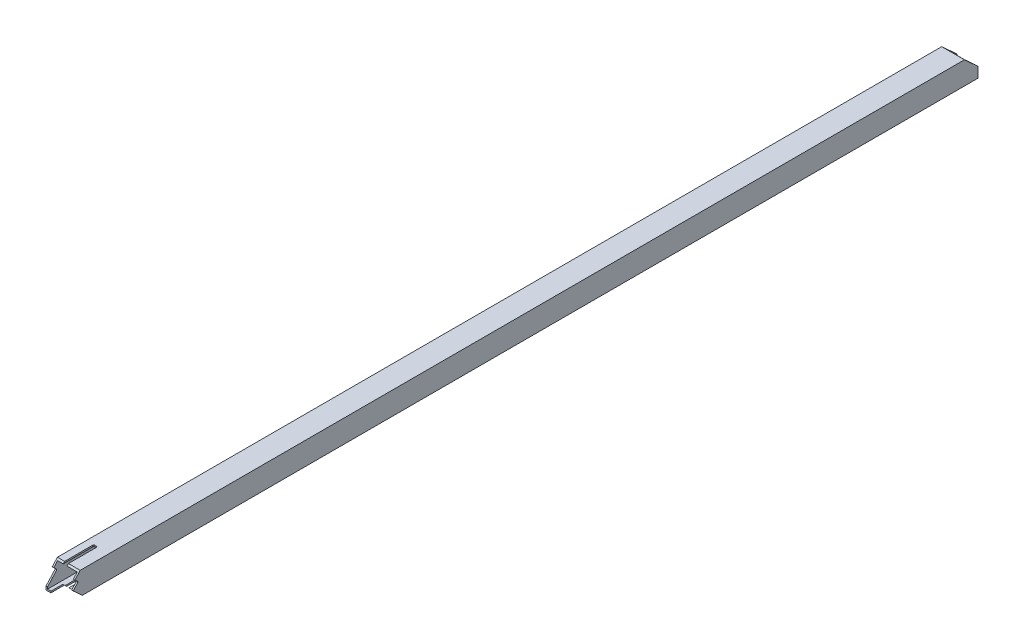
ISO-10303-21;
HEADER;
FILE_DESCRIPTION(('STEP AP214'),'2;1');
FILE_NAME('part.step','',(''),(''),'','','');
FILE_SCHEMA(('AUTOMOTIVE_DESIGN { 1 0 10303 214 1 1 1 1 }'));
ENDSEC;
DATA;
#1=APPLICATION_CONTEXT('core data for automotive mechanical design processes');
#2=APPLICATION_PROTOCOL_DEFINITION('international standard','automotive_design',2000,#1);
#3=PRODUCT_CONTEXT('',#1,'mechanical');
#4=PRODUCT('Part','Part','',(#3));
#5=PRODUCT_RELATED_PRODUCT_CATEGORY('part','',(#4));
#6=PRODUCT_DEFINITION_FORMATION('','',#4);
#7=PRODUCT_DEFINITION_CONTEXT('part definition',#1,'design');
#8=PRODUCT_DEFINITION('design','',#6,#7);
#9=PRODUCT_DEFINITION_SHAPE('','',#8);
#10=(LENGTH_UNIT() NAMED_UNIT(*) SI_UNIT(.MILLI.,.METRE.));
#11=(NAMED_UNIT(*) PLANE_ANGLE_UNIT() SI_UNIT($,.RADIAN.));
#12=(NAMED_UNIT(*) SI_UNIT($,.STERADIAN.) SOLID_ANGLE_UNIT());
#13=UNCERTAINTY_MEASURE_WITH_UNIT(LENGTH_MEASURE(1.E-05),#10,'distance_accuracy_value','');
#14=(GEOMETRIC_REPRESENTATION_CONTEXT(3) GLOBAL_UNCERTAINTY_ASSIGNED_CONTEXT((#13)) GLOBAL_UNIT_ASSIGNED_CONTEXT((#10,
#11,#12)) REPRESENTATION_CONTEXT('',''));
#15=CARTESIAN_POINT('',(0.,0.,0.));
#16=DIRECTION('',(0.,0.,1.));
#17=DIRECTION('',(1.,0.,0.));
#18=AXIS2_PLACEMENT_3D('',#15,#16,#17);
#19=CARTESIAN_POINT('',(-1.,3.344636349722,2323.848652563));
#20=DIRECTION('',(-1.,0.,0.));
#21=DIRECTION('',(0.,0.,1.));
#22=AXIS2_PLACEMENT_3D('',#19,#20,#21);
#23=PLANE('',#22);
#24=DIRECTION('',(0.,0.,-1.));
#25=VECTOR('',#24,1.);
#26=CARTESIAN_POINT('',(-1.,30.,1161.924326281));
#27=LINE('',#26,#25);
#28=CARTESIAN_POINT('',(-1.,30.,2369.268578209));
#29=VERTEX_POINT('',#28);
#30=CARTESIAN_POINT('',(-1.,30.,2294.595069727));
#31=VERTEX_POINT('',#30);
#32=EDGE_CURVE('E293',#29,#31,#27,.T.);
#33=ORIENTED_EDGE('',*,*,#32,.T.);
#34=DIRECTION('',(0.,-0.999022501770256,-0.0442045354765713));
#35=VECTOR('',#34,1.);
#36=CARTESIAN_POINT('',(-1.,110.65093685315,2298.163695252));
#37=LINE('',#36,#35);
#38=CARTESIAN_POINT('',(-1.,26.,2294.418078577));
#39=VERTEX_POINT('',#38);
#40=EDGE_CURVE('E10',#31,#39,#37,.T.);
#41=ORIENTED_EDGE('',*,*,#40,.T.);
#42=DIRECTION('',(0.,0.,-1.));
#43=VECTOR('',#42,1.);
#44=CARTESIAN_POINT('',(-1.,26.,1161.924326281));
#45=LINE('',#44,#43);
#46=CARTESIAN_POINT('',(-1.,26.,2372.929595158));
#47=VERTEX_POINT('',#46);
#48=EDGE_CURVE('E223',#47,#39,#45,.T.);
#49=ORIENTED_EDGE('',*,*,#48,.F.);
#50=DIRECTION('',(0.,-0.737672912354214,0.675158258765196));
#51=VECTOR('',#50,1.);
#52=CARTESIAN_POINT('',(-1.,645.40501344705,1806.016532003));
#53=LINE('',#52,#51);
#54=EDGE_CURVE('E289',#29,#47,#53,.T.);
#55=ORIENTED_EDGE('',*,*,#54,.F.);
#56=EDGE_LOOP('',(#33,#41,#49,#55));
#57=FACE_BOUND('',#56,.T.);
#58=ADVANCED_FACE('F16',(#57),#23,.T.);
#59=CARTESIAN_POINT('',(-3.,110.65093685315,2298.163695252));
#60=DIRECTION('',(0.,-0.999022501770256,-0.0442045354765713));
#61=DIRECTION('',(-1.,0.,0.));
#62=AXIS2_PLACEMENT_3D('',#59,#60,#61);
#63=CYLINDRICAL_SURFACE('',#62,2.);
#64=CARTESIAN_POINT('',(-3.,26.,2294.418078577));
#65=DIRECTION('',(0.,-1.,0.));
#66=DIRECTION('',(0.,0.,-1.));
#67=AXIS2_PLACEMENT_3D('',#64,#65,#66);
#68=ELLIPSE('',#67,2.001956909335,2.);
#69=CARTESIAN_POINT('',(-3.,26.,2292.416121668));
#70=VERTEX_POINT('',#69);
#71=EDGE_CURVE('E203',#70,#39,#68,.T.);
#72=ORIENTED_EDGE('',*,*,#71,.T.);
#73=ORIENTED_EDGE('',*,*,#40,.F.);
#74=CARTESIAN_POINT('',(-3.,30.,2294.595069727));
#75=DIRECTION('',(0.,-1.,0.));
#76=DIRECTION('',(0.,0.,-1.));
#77=AXIS2_PLACEMENT_3D('',#74,#75,#76);
#78=ELLIPSE('',#77,2.001956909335,2.);
#79=CARTESIAN_POINT('',(-3.,30.,2292.593112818));
#80=VERTEX_POINT('',#79);
#81=EDGE_CURVE('E206',#80,#31,#78,.T.);
#82=ORIENTED_EDGE('',*,*,#81,.F.);
#83=DIRECTION('',(0.,-0.999022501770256,-0.0442045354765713));
#84=VECTOR('',#83,1.);
#85=CARTESIAN_POINT('',(-3.,110.7393459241,2296.165650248));
#86=LINE('',#85,#84);
#87=EDGE_CURVE('E25',#80,#70,#86,.T.);
#88=ORIENTED_EDGE('',*,*,#87,.T.);
#89=EDGE_LOOP('',(#72,#73,#82,#88));
#90=FACE_BOUND('',#89,.T.);
#91=ADVANCED_FACE('F201',(#90),#63,.F.);
#92=CARTESIAN_POINT('',(-3.,110.7393459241,2296.165650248));
#93=DIRECTION('',(0.,-0.0442045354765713,0.999022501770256));
#94=DIRECTION('',(-1.,0.,0.));
#95=AXIS2_PLACEMENT_3D('',#92,#93,#94);
#96=PLANE('',#95);
#97=ORIENTED_EDGE('',*,*,#87,.F.);
#98=DIRECTION('',(-1.,0.,0.));
#99=VECTOR('',#98,1.);
#100=CARTESIAN_POINT('',(13.5,30.,2292.593112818));
#101=LINE('',#100,#99);
#102=CARTESIAN_POINT('',(-9.,30.,2292.593112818));
#103=VERTEX_POINT('',#102);
#104=EDGE_CURVE('E281',#80,#103,#101,.T.);
#105=ORIENTED_EDGE('',*,*,#104,.T.);
#106=DIRECTION('',(0.,-0.999022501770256,-0.0442045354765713));
#107=VECTOR('',#106,1.);
#108=CARTESIAN_POINT('',(-9.,110.7393459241,2296.165650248));
#109=LINE('',#108,#107);
#110=CARTESIAN_POINT('',(-9.,26.,2292.416121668));
#111=VERTEX_POINT('',#110);
#112=EDGE_CURVE('E211',#103,#111,#109,.T.);
#113=ORIENTED_EDGE('',*,*,#112,.T.);
#114=DIRECTION('',(-1.,0.,0.));
#115=VECTOR('',#114,1.);
#116=CARTESIAN_POINT('',(11.5,26.,2292.416121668));
#117=LINE('',#116,#115);
#118=EDGE_CURVE('E213',#70,#111,#117,.T.);
#119=ORIENTED_EDGE('',*,*,#118,.F.);
#120=EDGE_LOOP('',(#97,#105,#113,#119));
#121=FACE_BOUND('',#120,.T.);
#122=ADVANCED_FACE('F214',(#121),#96,.T.);
#123=CARTESIAN_POINT('',(-9.,110.65093685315,2298.163695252));
#124=DIRECTION('',(0.,-0.999022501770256,-0.0442045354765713));
#125=DIRECTION('',(1.,0.,0.));
#126=AXIS2_PLACEMENT_3D('',#123,#124,#125);
#127=CYLINDRICAL_SURFACE('',#126,2.);
#128=ORIENTED_EDGE('',*,*,#112,.F.);
#129=CARTESIAN_POINT('',(-9.,30.,2294.595069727));
#130=DIRECTION('',(0.,-1.,0.));
#131=DIRECTION('',(0.,0.,-1.));
#132=AXIS2_PLACEMENT_3D('',#129,#130,#131);
#133=ELLIPSE('',#132,2.001956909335,2.);
#134=CARTESIAN_POINT('',(-11.,30.,2294.595069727));
#135=VERTEX_POINT('',#134);
#136=EDGE_CURVE('E284',#135,#103,#133,.T.);
#137=ORIENTED_EDGE('',*,*,#136,.F.);
#138=DIRECTION('',(0.,-0.999022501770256,-0.0442045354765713));
#139=VECTOR('',#138,1.);
#140=CARTESIAN_POINT('',(-11.,110.65093685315,2298.163695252));
#141=LINE('',#140,#139);
#142=CARTESIAN_POINT('',(-11.,26.,2294.418078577));
#143=VERTEX_POINT('',#142);
#144=EDGE_CURVE('E38',#135,#143,#141,.T.);
#145=ORIENTED_EDGE('',*,*,#144,.T.);
#146=CARTESIAN_POINT('',(-9.,26.,2294.418078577));
#147=DIRECTION('',(0.,-1.,0.));
#148=DIRECTION('',(0.,0.,-1.));
#149=AXIS2_PLACEMENT_3D('',#146,#147,#148);
#150=ELLIPSE('',#149,2.001956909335,2.);
#151=EDGE_CURVE('E218',#143,#111,#150,.T.);
#152=ORIENTED_EDGE('',*,*,#151,.T.);
#153=EDGE_LOOP('',(#128,#137,#145,#152));
#154=FACE_BOUND('',#153,.T.);
#155=ADVANCED_FACE('F764',(#154),#127,.F.);
#156=CARTESIAN_POINT('',(-11.,3.344636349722,2323.848652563));
#157=DIRECTION('',(-1.,0.,0.));
#158=DIRECTION('',(0.,0.,1.));
#159=AXIS2_PLACEMENT_3D('',#156,#157,#158);
#160=PLANE('',#159);
#161=DIRECTION('',(0.,-0.737672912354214,0.675158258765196));
#162=VECTOR('',#161,1.);
#163=CARTESIAN_POINT('',(-11.,645.40501344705,1806.016532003));
#164=LINE('',#163,#162);
#165=CARTESIAN_POINT('',(-11.,30.,2369.268578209));
#166=VERTEX_POINT('',#165);
#167=CARTESIAN_POINT('',(-11.,26.,2372.929595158));
#168=VERTEX_POINT('',#167);
#169=EDGE_CURVE('E230',#166,#168,#164,.T.);
#170=ORIENTED_EDGE('',*,*,#169,.T.);
#171=DIRECTION('',(0.,0.,-1.));
#172=VECTOR('',#171,1.);
#173=CARTESIAN_POINT('',(-11.,26.,1161.924326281));
#174=LINE('',#173,#172);
#175=EDGE_CURVE('E278',#168,#143,#174,.T.);
#176=ORIENTED_EDGE('',*,*,#175,.T.);
#177=ORIENTED_EDGE('',*,*,#144,.F.);
#178=DIRECTION('',(0.,0.,-1.));
#179=VECTOR('',#178,1.);
#180=CARTESIAN_POINT('',(-11.,30.,1161.924326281));
#181=LINE('',#180,#179);
#182=EDGE_CURVE('E277',#166,#135,#181,.T.);
#183=ORIENTED_EDGE('',*,*,#182,.F.);
#184=EDGE_LOOP('',(#170,#176,#177,#183));
#185=FACE_BOUND('',#184,.T.);
#186=ADVANCED_FACE('F766',(#185),#160,.F.);
#187=CARTESIAN_POINT('',(26.,26.,0.));
#188=DIRECTION('',(0.,-1.,0.));
#189=DIRECTION('',(0.,0.,-1.));
#190=AXIS2_PLACEMENT_3D('',#187,#188,#189);
#191=PLANE('',#190);
#192=DIRECTION('',(-1.,0.,0.));
#193=VECTOR('',#192,1.);
#194=CARTESIAN_POINT('',(-8.00000005,26.,31.36967599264));
#195=LINE('',#194,#193);
#196=CARTESIAN_POINT('',(26.,26.,31.36967599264));
#197=VERTEX_POINT('',#196);
#198=CARTESIAN_POINT('',(-26.,26.,31.36967599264));
#199=VERTEX_POINT('',#198);
#200=EDGE_CURVE('E329',#197,#199,#195,.T.);
#201=ORIENTED_EDGE('',*,*,#200,.F.);
#202=DIRECTION('',(0.,0.,1.));
#203=VECTOR('',#202,1.);
#204=CARTESIAN_POINT('',(26.,26.,0.));
#205=LINE('',#204,#203);
#206=CARTESIAN_POINT('',(26.,26.,2372.929595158));
#207=VERTEX_POINT('',#206);
#208=EDGE_CURVE('E270',#197,#207,#205,.T.);
#209=ORIENTED_EDGE('',*,*,#208,.T.);
#210=DIRECTION('',(-1.,0.,0.));
#211=VECTOR('',#210,1.);
#212=CARTESIAN_POINT('',(-5.75,26.,2372.929595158));
#213=LINE('',#212,#211);
#214=EDGE_CURVE('E698',#207,#47,#213,.T.);
#215=ORIENTED_EDGE('',*,*,#214,.T.);
#216=ORIENTED_EDGE('',*,*,#48,.T.);
#217=ORIENTED_EDGE('',*,*,#71,.F.);
#218=ORIENTED_EDGE('',*,*,#118,.T.);
#219=ORIENTED_EDGE('',*,*,#151,.F.);
#220=ORIENTED_EDGE('',*,*,#175,.F.);
#221=DIRECTION('',(-1.,0.,0.));
#222=VECTOR('',#221,1.);
#223=CARTESIAN_POINT('',(-5.75,26.,2372.929595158));
#224=LINE('',#223,#222);
#225=CARTESIAN_POINT('',(-26.,26.,2372.929595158));
#226=VERTEX_POINT('',#225);
#227=EDGE_CURVE('E244',#168,#226,#224,.T.);
#228=ORIENTED_EDGE('',*,*,#227,.T.);
#229=DIRECTION('',(0.,0.,1.));
#230=VECTOR('',#229,1.);
#231=CARTESIAN_POINT('',(-26.,26.,0.));
#232=LINE('',#231,#230);
#233=EDGE_CURVE('E234',#199,#226,#232,.T.);
#234=ORIENTED_EDGE('',*,*,#233,.F.);
#235=EDGE_LOOP('',(#201,#209,#215,#216,#217,#218,#219,#220,#228,#234));
#236=FACE_BOUND('',#235,.T.);
#237=ADVANCED_FACE('F221',(#236),#191,.T.);
#238=CARTESIAN_POINT('',(-37.5,1252.693634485,1250.193048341));
#239=DIRECTION('',(0.,0.675158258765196,0.737672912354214));
#240=DIRECTION('',(1.,0.,0.));
#241=AXIS2_PLACEMENT_3D('',#238,#239,#240);
#242=PLANE('',#241);
#243=ORIENTED_EDGE('',*,*,#227,.F.);
#244=ORIENTED_EDGE('',*,*,#169,.F.);
#245=DIRECTION('',(-1.,0.,0.));
#246=VECTOR('',#245,1.);
#247=CARTESIAN_POINT('',(-3.75,30.,2369.268578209));
#248=LINE('',#247,#246);
#249=CARTESIAN_POINT('',(-30.,30.,2369.268578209));
#250=VERTEX_POINT('',#249);
#251=EDGE_CURVE('E274',#166,#250,#248,.T.);
#252=ORIENTED_EDGE('',*,*,#251,.T.);
#253=DIRECTION('',(0.,-0.737672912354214,0.675158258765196));
#254=VECTOR('',#253,1.);
#255=CARTESIAN_POINT('',(-30.,1231.349137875,1269.728689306));
#256=LINE('',#255,#254);
#257=CARTESIAN_POINT('',(-30.,14.878487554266,2383.108606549));
#258=VERTEX_POINT('',#257);
#259=EDGE_CURVE('E342',#250,#258,#256,.T.);
#260=ORIENTED_EDGE('',*,*,#259,.T.);
#261=DIRECTION('',(1.,0.,0.));
#262=VECTOR('',#261,1.);
#263=CARTESIAN_POINT('',(23.75,14.878487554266,2383.108606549));
#264=LINE('',#263,#262);
#265=CARTESIAN_POINT('',(-26.,14.878487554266,2383.108606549));
#266=VERTEX_POINT('',#265);
#267=EDGE_CURVE('E240',#258,#266,#264,.T.);
#268=ORIENTED_EDGE('',*,*,#267,.T.);
#269=DIRECTION('',(0.,-0.737672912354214,0.675158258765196));
#270=VECTOR('',#269,1.);
#271=CARTESIAN_POINT('',(-26.,1230.260815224,1270.724781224));
#272=LINE('',#271,#270);
#273=EDGE_CURVE('E236',#226,#266,#272,.T.);
#274=ORIENTED_EDGE('',*,*,#273,.F.);
#275=EDGE_LOOP('',(#243,#244,#252,#260,#268,#274));
#276=FACE_BOUND('',#275,.T.);
#277=ADVANCED_FACE('F648',(#276),#242,.T.);
#278=CARTESIAN_POINT('',(85.,8.126904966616,2375.731877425));
#279=DIRECTION('',(0.,-0.737672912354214,0.675158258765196));
#280=DIRECTION('',(-1.,0.,0.));
#281=AXIS2_PLACEMENT_3D('',#278,#279,#280);
#282=PLANE('',#281);
#283=DIRECTION('',(-1.,0.,0.));
#284=VECTOR('',#283,1.);
#285=CARTESIAN_POINT('',(85.,8.126904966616,2375.731877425));
#286=LINE('',#285,#284);
#287=CARTESIAN_POINT('',(-26.,8.126904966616,2375.731877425));
#288=VERTEX_POINT('',#287);
#289=CARTESIAN_POINT('',(-30.,8.126904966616,2375.731877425));
#290=VERTEX_POINT('',#289);
#291=EDGE_CURVE('E245',#288,#290,#286,.T.);
#292=ORIENTED_EDGE('',*,*,#291,.F.);
#293=DIRECTION('',(0.,-0.675158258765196,-0.737672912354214));
#294=VECTOR('',#293,1.);
#295=CARTESIAN_POINT('',(-26.,-579.4113017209,1733.791984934));
#296=LINE('',#295,#294);
#297=EDGE_CURVE('E239',#266,#288,#296,.T.);
#298=ORIENTED_EDGE('',*,*,#297,.F.);
#299=ORIENTED_EDGE('',*,*,#267,.F.);
#300=DIRECTION('',(0.,-0.675158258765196,-0.737672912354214));
#301=VECTOR('',#300,1.);
#302=CARTESIAN_POINT('',(-30.,-578.4996243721,1734.788076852));
#303=LINE('',#302,#301);
#304=EDGE_CURVE('E339',#258,#290,#303,.T.);
#305=ORIENTED_EDGE('',*,*,#304,.T.);
#306=EDGE_LOOP('',(#292,#298,#299,#305));
#307=FACE_BOUND('',#306,.T.);
#308=ADVANCED_FACE('F643',(#307),#282,.T.);
#309=CARTESIAN_POINT('',(85.,6.651559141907,2377.082193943));
#310=DIRECTION('',(-1.,0.,0.));
#311=DIRECTION('',(0.,0.675158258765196,0.737672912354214));
#312=AXIS2_PLACEMENT_3D('',#309,#310,#311);
#313=CYLINDRICAL_SURFACE('',#312,2.);
#314=CARTESIAN_POINT('',(-30.,6.651559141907,2377.082193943));
#315=DIRECTION('',(-1.,0.,0.));
#316=DIRECTION('',(0.,0.675158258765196,0.737672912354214));
#317=AXIS2_PLACEMENT_3D('',#314,#315,#316);
#318=CIRCLE('',#317,2.);
#319=CARTESIAN_POINT('',(-30.,5.301242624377,2375.606848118));
#320=VERTEX_POINT('',#319);
#321=EDGE_CURVE('E332',#290,#320,#318,.T.);
#322=ORIENTED_EDGE('',*,*,#321,.T.);
#323=DIRECTION('',(-1.,0.,0.));
#324=VECTOR('',#323,1.);
#325=CARTESIAN_POINT('',(85.,5.301242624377,2375.606848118));
#326=LINE('',#325,#324);
#327=CARTESIAN_POINT('',(-26.,5.301242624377,2375.606848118));
#328=VERTEX_POINT('',#327);
#329=EDGE_CURVE('E262',#328,#320,#326,.T.);
#330=ORIENTED_EDGE('',*,*,#329,.F.);
#331=CARTESIAN_POINT('',(-26.,6.651559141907,2377.082193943));
#332=DIRECTION('',(-1.,0.,0.));
#333=DIRECTION('',(0.,0.675158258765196,0.737672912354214));
#334=AXIS2_PLACEMENT_3D('',#331,#332,#333);
#335=CIRCLE('',#334,2.);
#336=EDGE_CURVE('E250',#288,#328,#335,.T.);
#337=ORIENTED_EDGE('',*,*,#336,.F.);
#338=ORIENTED_EDGE('',*,*,#291,.T.);
#339=EDGE_LOOP('',(#322,#330,#337,#338));
#340=FACE_BOUND('',#339,.T.);
#341=ADVANCED_FACE('F639',(#340),#313,.F.);
#342=CARTESIAN_POINT('',(25.,-38.95913211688,2416.116343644));
#343=DIRECTION('',(0.,0.675158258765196,0.737672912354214));
#344=DIRECTION('',(1.,0.,0.));
#345=AXIS2_PLACEMENT_3D('',#342,#343,#344);
#346=PLANE('',#345);
#347=ORIENTED_EDGE('',*,*,#329,.T.);
#348=DIRECTION('',(0.,-0.737672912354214,0.675158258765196));
#349=VECTOR('',#348,1.);
#350=CARTESIAN_POINT('',(-30.,581.47180502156,1848.264299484));
#351=LINE('',#350,#349);
#352=CARTESIAN_POINT('',(-30.,-20.73587909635,2399.4374341));
#353=VERTEX_POINT('',#352);
#354=EDGE_CURVE('E323',#320,#353,#351,.T.);
#355=ORIENTED_EDGE('',*,*,#354,.T.);
#356=DIRECTION('',(-1.,0.,0.));
#357=VECTOR('',#356,1.);
#358=CARTESIAN_POINT('',(12.5,-20.73587909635,2399.4374341));
#359=LINE('',#358,#357);
#360=CARTESIAN_POINT('',(-26.,-20.73587909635,2399.4374341));
#361=VERTEX_POINT('',#360);
#362=EDGE_CURVE('E316',#361,#353,#359,.T.);
#363=ORIENTED_EDGE('',*,*,#362,.F.);
#364=DIRECTION('',(0.,-0.737672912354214,0.675158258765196));
#365=VECTOR('',#364,1.);
#366=CARTESIAN_POINT('',(-26.,580.38348237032,1849.260391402));
#367=LINE('',#366,#365);
#368=EDGE_CURVE('E246',#328,#361,#367,.T.);
#369=ORIENTED_EDGE('',*,*,#368,.F.);
#370=EDGE_LOOP('',(#347,#355,#363,#369));
#371=FACE_BOUND('',#370,.T.);
#372=ADVANCED_FACE('F827',(#371),#346,.T.);
#373=CARTESIAN_POINT('',(25.,-38.95913211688,2416.116343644));
#374=DIRECTION('',(0.,0.675158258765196,0.737672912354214));
#375=DIRECTION('',(1.,0.,0.));
#376=AXIS2_PLACEMENT_3D('',#373,#374,#375);
#377=PLANE('',#376);
#378=DIRECTION('',(-1.,0.,0.));
#379=VECTOR('',#378,1.);
#380=CARTESIAN_POINT('',(85.,5.301242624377,2375.606848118));
#381=LINE('',#380,#379);
#382=CARTESIAN_POINT('',(30.,5.301242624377,2375.606848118));
#383=VERTEX_POINT('',#382);
#384=CARTESIAN_POINT('',(26.,5.301242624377,2375.606848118));
#385=VERTEX_POINT('',#384);
#386=EDGE_CURVE('E296',#383,#385,#381,.T.);
#387=ORIENTED_EDGE('',*,*,#386,.T.);
#388=DIRECTION('',(0.,0.737672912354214,-0.675158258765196));
#389=VECTOR('',#388,1.);
#390=CARTESIAN_POINT('',(26.,566.23528790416,1862.209586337));
#391=LINE('',#390,#389);
#392=CARTESIAN_POINT('',(26.,-7.976869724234,2387.759696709));
#393=VERTEX_POINT('',#392);
#394=EDGE_CURVE('E259',#393,#385,#391,.T.);
#395=ORIENTED_EDGE('',*,*,#394,.F.);
#396=DIRECTION('',(-1.,0.,0.));
#397=VECTOR('',#396,1.);
#398=CARTESIAN_POINT('',(3.99999995,-7.976869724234,2387.759696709));
#399=LINE('',#398,#397);
#400=CARTESIAN_POINT('',(30.,-7.976869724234,2387.759696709));
#401=VERTEX_POINT('',#400);
#402=EDGE_CURVE('E443',#401,#393,#399,.T.);
#403=ORIENTED_EDGE('',*,*,#402,.F.);
#404=DIRECTION('',(0.,0.737672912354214,-0.675158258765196));
#405=VECTOR('',#404,1.);
#406=CARTESIAN_POINT('',(30.,565.14696525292,1863.205678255));
#407=LINE('',#406,#405);
#408=EDGE_CURVE('E431',#401,#383,#407,.T.);
#409=ORIENTED_EDGE('',*,*,#408,.T.);
#410=EDGE_LOOP('',(#387,#395,#403,#409));
#411=FACE_BOUND('',#410,.T.);
#412=ADVANCED_FACE('F837',(#411),#377,.T.);
#413=CARTESIAN_POINT('',(85.,6.651559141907,2377.082193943));
#414=DIRECTION('',(-1.,0.,0.));
#415=DIRECTION('',(0.,0.675158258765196,0.737672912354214));
#416=AXIS2_PLACEMENT_3D('',#413,#414,#415);
#417=CYLINDRICAL_SURFACE('',#416,2.);
#418=CARTESIAN_POINT('',(26.,6.651559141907,2377.082193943));
#419=DIRECTION('',(-1.,0.,0.));
#420=DIRECTION('',(0.,0.675158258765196,0.737672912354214));
#421=AXIS2_PLACEMENT_3D('',#418,#419,#420);
#422=CIRCLE('',#421,2.);
#423=CARTESIAN_POINT('',(26.,8.126904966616,2375.731877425));
#424=VERTEX_POINT('',#423);
#425=EDGE_CURVE('E254',#424,#385,#422,.T.);
#426=ORIENTED_EDGE('',*,*,#425,.T.);
#427=ORIENTED_EDGE('',*,*,#386,.F.);
#428=CARTESIAN_POINT('',(30.,6.651559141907,2377.082193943));
#429=DIRECTION('',(-1.,0.,0.));
#430=DIRECTION('',(0.,0.675158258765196,0.737672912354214));
#431=AXIS2_PLACEMENT_3D('',#428,#429,#430);
#432=CIRCLE('',#431,2.);
#433=CARTESIAN_POINT('',(30.,8.126904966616,2375.731877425));
#434=VERTEX_POINT('',#433);
#435=EDGE_CURVE('E424',#434,#383,#432,.T.);
#436=ORIENTED_EDGE('',*,*,#435,.F.);
#437=DIRECTION('',(-1.,0.,0.));
#438=VECTOR('',#437,1.);
#439=CARTESIAN_POINT('',(85.,8.126904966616,2375.731877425));
#440=LINE('',#439,#438);
#441=EDGE_CURVE('E299',#434,#424,#440,.T.);
#442=ORIENTED_EDGE('',*,*,#441,.T.);
#443=EDGE_LOOP('',(#426,#427,#436,#442));
#444=FACE_BOUND('',#443,.T.);
#445=ADVANCED_FACE('F848',(#444),#417,.F.);
#446=CARTESIAN_POINT('',(85.,8.126904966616,2375.731877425));
#447=DIRECTION('',(0.,-0.737672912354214,0.675158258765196));
#448=DIRECTION('',(-1.,0.,0.));
#449=AXIS2_PLACEMENT_3D('',#446,#447,#448);
#450=PLANE('',#449);
#451=ORIENTED_EDGE('',*,*,#441,.F.);
#452=DIRECTION('',(0.,0.675158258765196,0.737672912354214));
#453=VECTOR('',#452,1.);
#454=CARTESIAN_POINT('',(30.,-592.1747846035,1719.84669808));
#455=LINE('',#454,#453);
#456=CARTESIAN_POINT('',(30.,14.878487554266,2383.108606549));
#457=VERTEX_POINT('',#456);
#458=EDGE_CURVE('E420',#434,#457,#455,.T.);
#459=ORIENTED_EDGE('',*,*,#458,.T.);
#460=DIRECTION('',(1.,0.,0.));
#461=VECTOR('',#460,1.);
#462=CARTESIAN_POINT('',(23.75,14.878487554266,2383.108606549));
#463=LINE('',#462,#461);
#464=CARTESIAN_POINT('',(26.,14.878487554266,2383.108606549));
#465=VERTEX_POINT('',#464);
#466=EDGE_CURVE('E285',#465,#457,#463,.T.);
#467=ORIENTED_EDGE('',*,*,#466,.F.);
#468=DIRECTION('',(0.,0.675158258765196,0.737672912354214));
#469=VECTOR('',#468,1.);
#470=CARTESIAN_POINT('',(26.,-591.2631072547,1720.842789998));
#471=LINE('',#470,#469);
#472=EDGE_CURVE('E258',#424,#465,#471,.T.);
#473=ORIENTED_EDGE('',*,*,#472,.F.);
#474=EDGE_LOOP('',(#451,#459,#467,#473));
#475=FACE_BOUND('',#474,.T.);
#476=ADVANCED_FACE('F858',(#475),#450,.T.);
#477=CARTESIAN_POINT('',(-37.5,1252.693634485,1250.193048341));
#478=DIRECTION('',(0.,0.675158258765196,0.737672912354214));
#479=DIRECTION('',(1.,0.,0.));
#480=AXIS2_PLACEMENT_3D('',#477,#478,#479);
#481=PLANE('',#480);
#482=DIRECTION('',(0.,0.737672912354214,-0.675158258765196));
#483=VECTOR('',#482,1.);
#484=CARTESIAN_POINT('',(26.,1216.112620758,1283.673976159));
#485=LINE('',#484,#483);
#486=EDGE_CURVE('E266',#465,#207,#485,.T.);
#487=ORIENTED_EDGE('',*,*,#486,.F.);
#488=ORIENTED_EDGE('',*,*,#466,.T.);
#489=DIRECTION('',(0.,0.737672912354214,-0.675158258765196));
#490=VECTOR('',#489,1.);
#491=CARTESIAN_POINT('',(30.,1215.024298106,1284.670068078));
#492=LINE('',#491,#490);
#493=CARTESIAN_POINT('',(30.,30.,2369.268578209));
#494=VERTEX_POINT('',#493);
#495=EDGE_CURVE('E416',#457,#494,#492,.T.);
#496=ORIENTED_EDGE('',*,*,#495,.T.);
#497=DIRECTION('',(-1.,0.,0.));
#498=VECTOR('',#497,1.);
#499=CARTESIAN_POINT('',(-3.75,30.,2369.268578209));
#500=LINE('',#499,#498);
#501=EDGE_CURVE('E290',#494,#29,#500,.T.);
#502=ORIENTED_EDGE('',*,*,#501,.T.);
#503=ORIENTED_EDGE('',*,*,#54,.T.);
#504=ORIENTED_EDGE('',*,*,#214,.F.);
#505=EDGE_LOOP('',(#487,#488,#496,#502,#503,#504));
#506=FACE_BOUND('',#505,.T.);
#507=ADVANCED_FACE('F621',(#506),#481,.T.);
#508=CARTESIAN_POINT('',(30.,30.,0.));
#509=DIRECTION('',(0.,-1.,0.));
#510=DIRECTION('',(0.,0.,-1.));
#511=AXIS2_PLACEMENT_3D('',#508,#509,#510);
#512=PLANE('',#511);
#513=DIRECTION('',(0.,0.,1.));
#514=VECTOR('',#513,1.);
#515=CARTESIAN_POINT('',(-30.,30.,0.));
#516=LINE('',#515,#514);
#517=CARTESIAN_POINT('',(-30.,30.,35.74004636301));
#518=VERTEX_POINT('',#517);
#519=EDGE_CURVE('E349',#518,#250,#516,.T.);
#520=ORIENTED_EDGE('',*,*,#519,.T.);
#521=ORIENTED_EDGE('',*,*,#251,.F.);
#522=ORIENTED_EDGE('',*,*,#182,.T.);
#523=ORIENTED_EDGE('',*,*,#136,.T.);
#524=ORIENTED_EDGE('',*,*,#104,.F.);
#525=ORIENTED_EDGE('',*,*,#81,.T.);
#526=ORIENTED_EDGE('',*,*,#32,.F.);
#527=ORIENTED_EDGE('',*,*,#501,.F.);
#528=DIRECTION('',(0.,0.,1.));
#529=VECTOR('',#528,1.);
#530=CARTESIAN_POINT('',(30.,30.,0.));
#531=LINE('',#530,#529);
#532=CARTESIAN_POINT('',(30.,30.,35.74004636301));
#533=VERTEX_POINT('',#532);
#534=EDGE_CURVE('E412',#533,#494,#531,.T.);
#535=ORIENTED_EDGE('',*,*,#534,.F.);
#536=DIRECTION('',(-1.,0.,0.));
#537=VECTOR('',#536,1.);
#538=CARTESIAN_POINT('',(-6.00000005,30.,35.74004636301));
#539=LINE('',#538,#537);
#540=EDGE_CURVE('E328',#533,#518,#539,.T.);
#541=ORIENTED_EDGE('',*,*,#540,.T.);
#542=EDGE_LOOP('',(#520,#521,#522,#523,#524,#525,#526,#527,#535,#541));
#543=FACE_BOUND('',#542,.T.);
#544=ADVANCED_FACE('F616',(#543),#512,.F.);
#545=CARTESIAN_POINT('',(26.,-26.,0.));
#546=DIRECTION('',(-1.,0.,0.));
#547=DIRECTION('',(0.,0.,1.));
#548=AXIS2_PLACEMENT_3D('',#545,#546,#547);
#549=PLANE('',#548);
#550=DIRECTION('',(0.,1.,0.));
#551=VECTOR('',#550,1.);
#552=CARTESIAN_POINT('',(26.,-26.,0.));
#553=LINE('',#552,#551);
#554=CARTESIAN_POINT('',(26.,-26.,0.));
#555=VERTEX_POINT('',#554);
#556=CARTESIAN_POINT('',(26.,-2.71122887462,0.));
#557=VERTEX_POINT('',#556);
#558=EDGE_CURVE('E386',#555,#557,#553,.T.);
#559=ORIENTED_EDGE('',*,*,#558,.F.);
#560=DIRECTION('',(0.,0.,1.));
#561=VECTOR('',#560,1.);
#562=CARTESIAN_POINT('',(26.,-26.,0.));
#563=LINE('',#562,#561);
#564=CARTESIAN_POINT('',(26.,-26.,2368.067758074));
#565=VERTEX_POINT('',#564);
#566=EDGE_CURVE('E253',#555,#565,#563,.T.);
#567=ORIENTED_EDGE('',*,*,#566,.T.);
#568=DIRECTION('',(0.,0.675158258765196,0.737672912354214));
#569=VECTOR('',#568,1.);
#570=CARTESIAN_POINT('',(26.,-1250.792702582,1029.868323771));
#571=LINE('',#570,#569);
#572=EDGE_CURVE('E447',#565,#393,#571,.T.);
#573=ORIENTED_EDGE('',*,*,#572,.T.);
#574=ORIENTED_EDGE('',*,*,#394,.T.);
#575=ORIENTED_EDGE('',*,*,#425,.F.);
#576=ORIENTED_EDGE('',*,*,#472,.T.);
#577=ORIENTED_EDGE('',*,*,#486,.T.);
#578=ORIENTED_EDGE('',*,*,#208,.F.);
#579=DIRECTION('',(0.,0.675158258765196,0.737672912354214));
#580=VECTOR('',#579,1.);
#581=CARTESIAN_POINT('',(26.,-51.96169377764,-53.81069313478));
#582=LINE('',#581,#580);
#583=EDGE_CURVE('E336',#557,#197,#582,.T.);
#584=ORIENTED_EDGE('',*,*,#583,.F.);
#585=EDGE_LOOP('',(#559,#567,#573,#574,#575,#576,#577,#578,#584));
#586=FACE_BOUND('',#585,.T.);
#587=ADVANCED_FACE('F885',(#586),#549,.T.);
#588=CARTESIAN_POINT('',(-26.,-26.,0.));
#589=DIRECTION('',(0.,1.,0.));
#590=DIRECTION('',(1.,0.,0.));
#591=AXIS2_PLACEMENT_3D('',#588,#589,#590);
#592=PLANE('',#591);
#593=DIRECTION('',(1.,0.,0.));
#594=VECTOR('',#593,1.);
#595=CARTESIAN_POINT('',(-26.,-26.,0.));
#596=LINE('',#595,#594);
#597=CARTESIAN_POINT('',(-26.,-26.,0.));
#598=VERTEX_POINT('',#597);
#599=EDGE_CURVE('E382',#598,#555,#596,.T.);
#600=ORIENTED_EDGE('',*,*,#599,.F.);
#601=DIRECTION('',(0.,0.,1.));
#602=VECTOR('',#601,1.);
#603=CARTESIAN_POINT('',(-26.,-26.,0.));
#604=LINE('',#603,#602);
#605=CARTESIAN_POINT('',(-26.,-26.,2399.4374341));
#606=VERTEX_POINT('',#605);
#607=EDGE_CURVE('E249',#598,#606,#604,.T.);
#608=ORIENTED_EDGE('',*,*,#607,.T.);
#609=DIRECTION('',(1.,0.,0.));
#610=VECTOR('',#609,1.);
#611=CARTESIAN_POINT('',(-26.,-26.,2399.4374341));
#612=LINE('',#611,#610);
#613=CARTESIAN_POINT('',(-17.0000001,-26.,2399.4374341));
#614=VERTEX_POINT('',#613);
#615=EDGE_CURVE('E320',#606,#614,#612,.T.);
#616=ORIENTED_EDGE('',*,*,#615,.T.);
#617=DIRECTION('',(0.,0.,-1.));
#618=VECTOR('',#617,1.);
#619=CARTESIAN_POINT('',(-17.0000001,-26.,490.13988993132));
#620=LINE('',#619,#618);
#621=CARTESIAN_POINT('',(-17.0000001,-26.,2368.067758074));
#622=VERTEX_POINT('',#621);
#623=EDGE_CURVE('E373',#614,#622,#620,.T.);
#624=ORIENTED_EDGE('',*,*,#623,.T.);
#625=DIRECTION('',(1.,0.,0.));
#626=VECTOR('',#625,1.);
#627=CARTESIAN_POINT('',(-21.50000005,-26.,2368.067758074));
#628=LINE('',#627,#626);
#629=CARTESIAN_POINT('',(-11.,-26.,2368.067758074));
#630=VERTEX_POINT('',#629);
#631=EDGE_CURVE('E378',#622,#630,#628,.T.);
#632=ORIENTED_EDGE('',*,*,#631,.T.);
#633=DIRECTION('',(0.,0.,1.));
#634=VECTOR('',#633,1.);
#635=CARTESIAN_POINT('',(-11.,-26.,1161.924326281));
#636=LINE('',#635,#634);
#637=CARTESIAN_POINT('',(-11.,-26.,2292.117193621));
#638=VERTEX_POINT('',#637);
#639=EDGE_CURVE('E487',#638,#630,#636,.T.);
#640=ORIENTED_EDGE('',*,*,#639,.F.);
#641=CARTESIAN_POINT('',(-9.,-26.,2292.117193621));
#642=DIRECTION('',(0.,1.,0.));
#643=DIRECTION('',(0.,0.,-1.));
#644=AXIS2_PLACEMENT_3D('',#641,#642,#643);
#645=ELLIPSE('',#644,2.001956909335,2.);
#646=CARTESIAN_POINT('',(-9.,-26.,2290.115236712));
#647=VERTEX_POINT('',#646);
#648=EDGE_CURVE('E474',#647,#638,#645,.T.);
#649=ORIENTED_EDGE('',*,*,#648,.F.);
#650=DIRECTION('',(1.,0.,0.));
#651=VECTOR('',#650,1.);
#652=CARTESIAN_POINT('',(-14.5,-26.,2290.115236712));
#653=LINE('',#652,#651);
#654=CARTESIAN_POINT('',(-3.,-26.,2290.115236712));
#655=VERTEX_POINT('',#654);
#656=EDGE_CURVE('E475',#647,#655,#653,.T.);
#657=ORIENTED_EDGE('',*,*,#656,.T.);
#658=CARTESIAN_POINT('',(-2.999999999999,-26.,2292.117193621));
#659=DIRECTION('',(0.,1.,0.));
#660=DIRECTION('',(0.,0.,-1.));
#661=AXIS2_PLACEMENT_3D('',#658,#659,#660);
#662=ELLIPSE('',#661,2.001956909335,2.);
#663=CARTESIAN_POINT('',(-1.,-26.,2292.117193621));
#664=VERTEX_POINT('',#663);
#665=EDGE_CURVE('E465',#664,#655,#662,.T.);
#666=ORIENTED_EDGE('',*,*,#665,.F.);
#667=DIRECTION('',(0.,0.,1.));
#668=VECTOR('',#667,1.);
#669=CARTESIAN_POINT('',(-1.,-26.,1161.924326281));
#670=LINE('',#669,#668);
#671=CARTESIAN_POINT('',(-1.,-26.,2368.067758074));
#672=VERTEX_POINT('',#671);
#673=EDGE_CURVE('E459',#664,#672,#670,.T.);
#674=ORIENTED_EDGE('',*,*,#673,.T.);
#675=DIRECTION('',(1.,0.,0.));
#676=VECTOR('',#675,1.);
#677=CARTESIAN_POINT('',(-21.50000005,-26.,2368.067758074));
#678=LINE('',#677,#676);
#679=EDGE_CURVE('E451',#672,#565,#678,.T.);
#680=ORIENTED_EDGE('',*,*,#679,.T.);
#681=ORIENTED_EDGE('',*,*,#566,.F.);
#682=EDGE_LOOP('',(#600,#608,#616,#624,#632,#640,#649,#657,#666,#674,#680,#681));
#683=FACE_BOUND('',#682,.T.);
#684=ADVANCED_FACE('F530',(#683),#592,.T.);
#685=CARTESIAN_POINT('',(-26.,26.,0.));
#686=DIRECTION('',(1.,0.,0.));
#687=DIRECTION('',(0.,1.,0.));
#688=AXIS2_PLACEMENT_3D('',#685,#686,#687);
#689=PLANE('',#688);
#690=DIRECTION('',(0.,-0.675158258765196,-0.737672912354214));
#691=VECTOR('',#690,1.);
#692=CARTESIAN_POINT('',(-26.,-40.1098882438,-40.86149819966));
#693=LINE('',#692,#691);
#694=CARTESIAN_POINT('',(-26.,-2.71122887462,0.));
#695=VERTEX_POINT('',#694);
#696=EDGE_CURVE('E324',#199,#695,#693,.T.);
#697=ORIENTED_EDGE('',*,*,#696,.F.);
#698=ORIENTED_EDGE('',*,*,#233,.T.);
#699=ORIENTED_EDGE('',*,*,#273,.T.);
#700=ORIENTED_EDGE('',*,*,#297,.T.);
#701=ORIENTED_EDGE('',*,*,#336,.T.);
#702=ORIENTED_EDGE('',*,*,#368,.T.);
#703=DIRECTION('',(0.,-1.,0.));
#704=VECTOR('',#703,1.);
#705=CARTESIAN_POINT('',(-26.,26.,2399.4374341));
#706=LINE('',#705,#704);
#707=EDGE_CURVE('E314',#361,#606,#706,.T.);
#708=ORIENTED_EDGE('',*,*,#707,.T.);
#709=ORIENTED_EDGE('',*,*,#607,.F.);
#710=DIRECTION('',(0.,-1.,0.));
#711=VECTOR('',#710,1.);
#712=CARTESIAN_POINT('',(-26.,26.,0.));
#713=LINE('',#712,#711);
#714=EDGE_CURVE('E372',#695,#598,#713,.T.);
#715=ORIENTED_EDGE('',*,*,#714,.F.);
#716=EDGE_LOOP('',(#697,#698,#699,#700,#701,#702,#708,#709,#715));
#717=FACE_BOUND('',#716,.T.);
#718=ADVANCED_FACE('F522',(#717),#689,.T.);
#719=CARTESIAN_POINT('',(-42.0000001,-90.59623612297,-96.02250791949));
#720=DIRECTION('',(0.,-0.737672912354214,0.675158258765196));
#721=DIRECTION('',(-1.,0.,0.));
#722=AXIS2_PLACEMENT_3D('',#719,#720,#721);
#723=PLANE('',#722);
#724=ORIENTED_EDGE('',*,*,#583,.T.);
#725=ORIENTED_EDGE('',*,*,#200,.T.);
#726=ORIENTED_EDGE('',*,*,#696,.T.);
#727=DIRECTION('',(1.,0.,0.));
#728=VECTOR('',#727,1.);
#729=CARTESIAN_POINT('',(-21.00000005,-2.71122887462,0.));
#730=LINE('',#729,#728);
#731=CARTESIAN_POINT('',(-30.,-2.71122887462,0.));
#732=VERTEX_POINT('',#731);
#733=EDGE_CURVE('E368',#732,#695,#730,.T.);
#734=ORIENTED_EDGE('',*,*,#733,.F.);
#735=DIRECTION('',(0.,-0.675158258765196,-0.737672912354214));
#736=VECTOR('',#735,1.);
#737=CARTESIAN_POINT('',(-30.,-39.19821089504,-39.86540628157));
#738=LINE('',#737,#736);
#739=EDGE_CURVE('E358',#518,#732,#738,.T.);
#740=ORIENTED_EDGE('',*,*,#739,.F.);
#741=ORIENTED_EDGE('',*,*,#540,.F.);
#742=DIRECTION('',(0.,0.675158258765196,0.737672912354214));
#743=VECTOR('',#742,1.);
#744=CARTESIAN_POINT('',(30.,-52.8733711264,-54.80678505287));
#745=LINE('',#744,#743);
#746=CARTESIAN_POINT('',(30.,-2.71122887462,0.));
#747=VERTEX_POINT('',#746);
#748=EDGE_CURVE('E405',#747,#533,#745,.T.);
#749=ORIENTED_EDGE('',*,*,#748,.F.);
#750=DIRECTION('',(1.,0.,0.));
#751=VECTOR('',#750,1.);
#752=CARTESIAN_POINT('',(-21.00000005,-2.71122887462,0.));
#753=LINE('',#752,#751);
#754=EDGE_CURVE('E390',#557,#747,#753,.T.);
#755=ORIENTED_EDGE('',*,*,#754,.F.);
#756=EDGE_LOOP('',(#724,#725,#726,#734,#740,#741,#749,#755));
#757=FACE_BOUND('',#756,.T.);
#758=ADVANCED_FACE('F629',(#757),#723,.F.);
#759=CARTESIAN_POINT('',(-30.,30.,0.));
#760=DIRECTION('',(1.,0.,0.));
#761=DIRECTION('',(0.,1.,0.));
#762=AXIS2_PLACEMENT_3D('',#759,#760,#761);
#763=PLANE('',#762);
#764=DIRECTION('',(0.,-1.,0.));
#765=VECTOR('',#764,1.);
#766=CARTESIAN_POINT('',(-30.,30.,0.));
#767=LINE('',#766,#765);
#768=CARTESIAN_POINT('',(-30.,-30.,0.));
#769=VERTEX_POINT('',#768);
#770=EDGE_CURVE('E401',#732,#769,#767,.T.);
#771=ORIENTED_EDGE('',*,*,#770,.T.);
#772=DIRECTION('',(0.,0.,1.));
#773=VECTOR('',#772,1.);
#774=CARTESIAN_POINT('',(-30.,-30.,0.));
#775=LINE('',#774,#773);
#776=CARTESIAN_POINT('',(-30.,-30.,2399.4374341));
#777=VERTEX_POINT('',#776);
#778=EDGE_CURVE('E363',#769,#777,#775,.T.);
#779=ORIENTED_EDGE('',*,*,#778,.T.);
#780=DIRECTION('',(0.,-1.,0.));
#781=VECTOR('',#780,1.);
#782=CARTESIAN_POINT('',(-30.,30.,2399.4374341));
#783=LINE('',#782,#781);
#784=EDGE_CURVE('E318',#353,#777,#783,.T.);
#785=ORIENTED_EDGE('',*,*,#784,.F.);
#786=ORIENTED_EDGE('',*,*,#354,.F.);
#787=ORIENTED_EDGE('',*,*,#321,.F.);
#788=ORIENTED_EDGE('',*,*,#304,.F.);
#789=ORIENTED_EDGE('',*,*,#259,.F.);
#790=ORIENTED_EDGE('',*,*,#519,.F.);
#791=ORIENTED_EDGE('',*,*,#739,.T.);
#792=EDGE_LOOP('',(#771,#779,#785,#786,#787,#788,#789,#790,#791));
#793=FACE_BOUND('',#792,.T.);
#794=ADVANCED_FACE('F635',(#793),#763,.F.);
#795=CARTESIAN_POINT('',(0.,0.,2399.4374341));
#796=DIRECTION('',(0.,0.,1.));
#797=DIRECTION('',(1.,0.,0.));
#798=AXIS2_PLACEMENT_3D('',#795,#796,#797);
#799=PLANE('',#798);
#800=ORIENTED_EDGE('',*,*,#707,.F.);
#801=ORIENTED_EDGE('',*,*,#362,.T.);
#802=ORIENTED_EDGE('',*,*,#784,.T.);
#803=DIRECTION('',(1.,0.,0.));
#804=VECTOR('',#803,1.);
#805=CARTESIAN_POINT('',(-30.,-30.,2399.4374341));
#806=LINE('',#805,#804);
#807=CARTESIAN_POINT('',(-17.0000001,-30.,2399.4374341));
#808=VERTEX_POINT('',#807);
#809=EDGE_CURVE('E367',#777,#808,#806,.T.);
#810=ORIENTED_EDGE('',*,*,#809,.T.);
#811=DIRECTION('',(0.,1.,0.));
#812=VECTOR('',#811,1.);
#813=CARTESIAN_POINT('',(-17.0000001,-648.0894137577,2399.4374341));
#814=LINE('',#813,#812);
#815=EDGE_CURVE('E377',#808,#614,#814,.T.);
#816=ORIENTED_EDGE('',*,*,#815,.T.);
#817=ORIENTED_EDGE('',*,*,#615,.F.);
#818=EDGE_LOOP('',(#800,#801,#802,#810,#816,#817));
#819=FACE_BOUND('',#818,.T.);
#820=ADVANCED_FACE('F528',(#819),#799,.T.);
#821=CARTESIAN_POINT('',(-17.0000001,-1296.178827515,980.27977986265));
#822=DIRECTION('',(1.,0.,0.));
#823=DIRECTION('',(0.,1.,0.));
#824=AXIS2_PLACEMENT_3D('',#821,#822,#823);
#825=PLANE('',#824);
#826=DIRECTION('',(0.,0.,-1.));
#827=VECTOR('',#826,1.);
#828=CARTESIAN_POINT('',(-17.0000001,-30.,490.13988993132));
#829=LINE('',#828,#827);
#830=CARTESIAN_POINT('',(-17.0000001,-30.,2363.697387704));
#831=VERTEX_POINT('',#830);
#832=EDGE_CURVE('E658',#808,#831,#829,.T.);
#833=ORIENTED_EDGE('',*,*,#832,.T.);
#834=DIRECTION('',(0.,0.675158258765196,0.737672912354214));
#835=VECTOR('',#834,1.);
#836=CARTESIAN_POINT('',(-17.0000001,-1296.178827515,980.27977986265));
#837=LINE('',#836,#835);
#838=EDGE_CURVE('E498',#831,#622,#837,.T.);
#839=ORIENTED_EDGE('',*,*,#838,.T.);
#840=ORIENTED_EDGE('',*,*,#623,.F.);
#841=ORIENTED_EDGE('',*,*,#815,.F.);
#842=EDGE_LOOP('',(#833,#839,#840,#841));
#843=FACE_BOUND('',#842,.T.);
#844=ADVANCED_FACE('F720',(#843),#825,.T.);
#845=CARTESIAN_POINT('',(-17.0000001,-1296.178827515,980.27977986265));
#846=DIRECTION('',(0.,-0.737672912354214,0.675158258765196));
#847=DIRECTION('',(-1.,0.,0.));
#848=AXIS2_PLACEMENT_3D('',#845,#846,#847);
#849=PLANE('',#848);
#850=ORIENTED_EDGE('',*,*,#838,.F.);
#851=DIRECTION('',(1.,0.,0.));
#852=VECTOR('',#851,1.);
#853=CARTESIAN_POINT('',(-23.50000005,-30.,2363.697387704));
#854=LINE('',#853,#852);
#855=CARTESIAN_POINT('',(-11.,-30.,2363.697387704));
#856=VERTEX_POINT('',#855);
#857=EDGE_CURVE('E676',#831,#856,#854,.T.);
#858=ORIENTED_EDGE('',*,*,#857,.T.);
#859=DIRECTION('',(0.,-0.675158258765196,-0.737672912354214));
#860=VECTOR('',#859,1.);
#861=CARTESIAN_POINT('',(-11.,-665.4127770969,1669.450094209));
#862=LINE('',#861,#860);
#863=EDGE_CURVE('E491',#630,#856,#862,.T.);
#864=ORIENTED_EDGE('',*,*,#863,.F.);
#865=ORIENTED_EDGE('',*,*,#631,.F.);
#866=EDGE_LOOP('',(#850,#858,#864,#865));
#867=FACE_BOUND('',#866,.T.);
#868=ADVANCED_FACE('F708',(#867),#849,.T.);
#869=CARTESIAN_POINT('',(-11.,3.344636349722,2323.848652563));
#870=DIRECTION('',(-1.,0.,0.));
#871=DIRECTION('',(0.,0.,1.));
#872=AXIS2_PLACEMENT_3D('',#869,#870,#871);
#873=PLANE('',#872);
#874=ORIENTED_EDGE('',*,*,#639,.T.);
#875=ORIENTED_EDGE('',*,*,#863,.T.);
#876=DIRECTION('',(0.,0.,1.));
#877=VECTOR('',#876,1.);
#878=CARTESIAN_POINT('',(-11.,-30.,1161.924326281));
#879=LINE('',#878,#877);
#880=CARTESIAN_POINT('',(-11.,-30.,2291.940202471));
#881=VERTEX_POINT('',#880);
#882=EDGE_CURVE('E672',#881,#856,#879,.T.);
#883=ORIENTED_EDGE('',*,*,#882,.F.);
#884=DIRECTION('',(0.,-0.999022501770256,-0.0442045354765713));
#885=VECTOR('',#884,1.);
#886=CARTESIAN_POINT('',(-11.,110.65093685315,2298.163695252));
#887=LINE('',#886,#885);
#888=EDGE_CURVE('E484',#638,#881,#887,.T.);
#889=ORIENTED_EDGE('',*,*,#888,.F.);
#890=EDGE_LOOP('',(#874,#875,#883,#889));
#891=FACE_BOUND('',#890,.T.);
#892=ADVANCED_FACE('F717',(#891),#873,.F.);
#893=CARTESIAN_POINT('',(-9.,110.65093685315,2298.163695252));
#894=DIRECTION('',(0.,-0.999022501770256,-0.0442045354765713));
#895=DIRECTION('',(1.,0.,0.));
#896=AXIS2_PLACEMENT_3D('',#893,#894,#895);
#897=CYLINDRICAL_SURFACE('',#896,2.);
#898=DIRECTION('',(0.,-0.999022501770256,-0.0442045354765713));
#899=VECTOR('',#898,1.);
#900=CARTESIAN_POINT('',(-9.,110.7393459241,2296.165650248));
#901=LINE('',#900,#899);
#902=CARTESIAN_POINT('',(-9.,-30.,2289.938245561));
#903=VERTEX_POINT('',#902);
#904=EDGE_CURVE('E470',#647,#903,#901,.T.);
#905=ORIENTED_EDGE('',*,*,#904,.F.);
#906=ORIENTED_EDGE('',*,*,#648,.T.);
#907=ORIENTED_EDGE('',*,*,#888,.T.);
#908=CARTESIAN_POINT('',(-9.,-30.,2291.940202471));
#909=DIRECTION('',(0.,1.,0.));
#910=DIRECTION('',(0.,0.,-1.));
#911=AXIS2_PLACEMENT_3D('',#908,#909,#910);
#912=ELLIPSE('',#911,2.001956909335,2.);
#913=EDGE_CURVE('E668',#903,#881,#912,.T.);
#914=ORIENTED_EDGE('',*,*,#913,.F.);
#915=EDGE_LOOP('',(#905,#906,#907,#914));
#916=FACE_BOUND('',#915,.T.);
#917=ADVANCED_FACE('F748',(#916),#897,.F.);
#918=CARTESIAN_POINT('',(-3.,110.7393459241,2296.165650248));
#919=DIRECTION('',(0.,-0.0442045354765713,0.999022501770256));
#920=DIRECTION('',(-1.,0.,0.));
#921=AXIS2_PLACEMENT_3D('',#918,#919,#920);
#922=PLANE('',#921);
#923=DIRECTION('',(0.,-0.999022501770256,-0.0442045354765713));
#924=VECTOR('',#923,1.);
#925=CARTESIAN_POINT('',(-3.,110.7393459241,2296.165650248));
#926=LINE('',#925,#924);
#927=CARTESIAN_POINT('',(-3.,-30.,2289.938245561));
#928=VERTEX_POINT('',#927);
#929=EDGE_CURVE('E469',#655,#928,#926,.T.);
#930=ORIENTED_EDGE('',*,*,#929,.F.);
#931=ORIENTED_EDGE('',*,*,#656,.F.);
#932=ORIENTED_EDGE('',*,*,#904,.T.);
#933=DIRECTION('',(1.,0.,0.));
#934=VECTOR('',#933,1.);
#935=CARTESIAN_POINT('',(-16.5,-30.,2289.938245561));
#936=LINE('',#935,#934);
#937=EDGE_CURVE('E673',#903,#928,#936,.T.);
#938=ORIENTED_EDGE('',*,*,#937,.T.);
#939=EDGE_LOOP('',(#930,#931,#932,#938));
#940=FACE_BOUND('',#939,.T.);
#941=ADVANCED_FACE('F746',(#940),#922,.T.);
#942=CARTESIAN_POINT('',(-3.,110.65093685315,2298.163695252));
#943=DIRECTION('',(0.,-0.999022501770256,-0.0442045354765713));
#944=DIRECTION('',(-1.,0.,0.));
#945=AXIS2_PLACEMENT_3D('',#942,#943,#944);
#946=CYLINDRICAL_SURFACE('',#945,2.);
#947=CARTESIAN_POINT('',(-2.999999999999,-30.,2291.940202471));
#948=DIRECTION('',(0.,1.,0.));
#949=DIRECTION('',(0.,0.,-1.));
#950=AXIS2_PLACEMENT_3D('',#947,#948,#949);
#951=ELLIPSE('',#950,2.001956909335,2.);
#952=CARTESIAN_POINT('',(-1.,-30.,2291.940202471));
#953=VERTEX_POINT('',#952);
#954=EDGE_CURVE('E681',#953,#928,#951,.T.);
#955=ORIENTED_EDGE('',*,*,#954,.F.);
#956=DIRECTION('',(0.,-0.999022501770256,-0.0442045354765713));
#957=VECTOR('',#956,1.);
#958=CARTESIAN_POINT('',(-1.,110.65093685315,2298.163695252));
#959=LINE('',#958,#957);
#960=EDGE_CURVE('E455',#664,#953,#959,.T.);
#961=ORIENTED_EDGE('',*,*,#960,.F.);
#962=ORIENTED_EDGE('',*,*,#665,.T.);
#963=ORIENTED_EDGE('',*,*,#929,.T.);
#964=EDGE_LOOP('',(#955,#961,#962,#963));
#965=FACE_BOUND('',#964,.T.);
#966=ADVANCED_FACE('F742',(#965),#946,.F.);
#967=CARTESIAN_POINT('',(-1.,3.344636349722,2323.848652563));
#968=DIRECTION('',(-1.,0.,0.));
#969=DIRECTION('',(0.,0.,1.));
#970=AXIS2_PLACEMENT_3D('',#967,#968,#969);
#971=PLANE('',#970);
#972=ORIENTED_EDGE('',*,*,#960,.T.);
#973=DIRECTION('',(0.,0.,1.));
#974=VECTOR('',#973,1.);
#975=CARTESIAN_POINT('',(-1.,-30.,1161.924326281));
#976=LINE('',#975,#974);
#977=CARTESIAN_POINT('',(-1.,-30.,2363.697387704));
#978=VERTEX_POINT('',#977);
#979=EDGE_CURVE('E666',#953,#978,#976,.T.);
#980=ORIENTED_EDGE('',*,*,#979,.T.);
#981=DIRECTION('',(0.,-0.675158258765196,-0.737672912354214));
#982=VECTOR('',#981,1.);
#983=CARTESIAN_POINT('',(-1.,-665.4127770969,1669.450094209));
#984=LINE('',#983,#982);
#985=EDGE_CURVE('E439',#672,#978,#984,.T.);
#986=ORIENTED_EDGE('',*,*,#985,.F.);
#987=ORIENTED_EDGE('',*,*,#673,.F.);
#988=EDGE_LOOP('',(#972,#980,#986,#987));
#989=FACE_BOUND('',#988,.T.);
#990=ADVANCED_FACE('F738',(#989),#971,.T.);
#991=CARTESIAN_POINT('',(-17.0000001,-1296.178827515,980.27977986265));
#992=DIRECTION('',(0.,-0.737672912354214,0.675158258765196));
#993=DIRECTION('',(-1.,0.,0.));
#994=AXIS2_PLACEMENT_3D('',#991,#992,#993);
#995=PLANE('',#994);
#996=ORIENTED_EDGE('',*,*,#985,.T.);
#997=DIRECTION('',(1.,0.,0.));
#998=VECTOR('',#997,1.);
#999=CARTESIAN_POINT('',(-23.50000005,-30.,2363.697387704));
#1000=LINE('',#999,#998);
#1001=CARTESIAN_POINT('',(30.,-30.,2363.697387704));
#1002=VERTEX_POINT('',#1001);
#1003=EDGE_CURVE('E663',#978,#1002,#1000,.T.);
#1004=ORIENTED_EDGE('',*,*,#1003,.T.);
#1005=DIRECTION('',(0.,0.675158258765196,0.737672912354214));
#1006=VECTOR('',#1005,1.);
#1007=CARTESIAN_POINT('',(30.,-1251.704379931,1028.872231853));
#1008=LINE('',#1007,#1006);
#1009=EDGE_CURVE('E435',#1002,#401,#1008,.T.);
#1010=ORIENTED_EDGE('',*,*,#1009,.T.);
#1011=ORIENTED_EDGE('',*,*,#402,.T.);
#1012=ORIENTED_EDGE('',*,*,#572,.F.);
#1013=ORIENTED_EDGE('',*,*,#679,.F.);
#1014=EDGE_LOOP('',(#996,#1004,#1010,#1011,#1012,#1013));
#1015=FACE_BOUND('',#1014,.T.);
#1016=ADVANCED_FACE('F732',(#1015),#995,.T.);
#1017=CARTESIAN_POINT('',(30.,-30.,0.));
#1018=DIRECTION('',(-1.,0.,0.));
#1019=DIRECTION('',(0.,0.,1.));
#1020=AXIS2_PLACEMENT_3D('',#1017,#1018,#1019);
#1021=PLANE('',#1020);
#1022=ORIENTED_EDGE('',*,*,#748,.T.);
#1023=ORIENTED_EDGE('',*,*,#534,.T.);
#1024=ORIENTED_EDGE('',*,*,#495,.F.);
#1025=ORIENTED_EDGE('',*,*,#458,.F.);
#1026=ORIENTED_EDGE('',*,*,#435,.T.);
#1027=ORIENTED_EDGE('',*,*,#408,.F.);
#1028=ORIENTED_EDGE('',*,*,#1009,.F.);
#1029=DIRECTION('',(0.,0.,1.));
#1030=VECTOR('',#1029,1.);
#1031=CARTESIAN_POINT('',(30.,-30.,0.));
#1032=LINE('',#1031,#1030);
#1033=CARTESIAN_POINT('',(30.,-30.,0.));
#1034=VERTEX_POINT('',#1033);
#1035=EDGE_CURVE('E659',#1034,#1002,#1032,.T.);
#1036=ORIENTED_EDGE('',*,*,#1035,.F.);
#1037=DIRECTION('',(0.,1.,0.));
#1038=VECTOR('',#1037,1.);
#1039=CARTESIAN_POINT('',(30.,-30.,0.));
#1040=LINE('',#1039,#1038);
#1041=EDGE_CURVE('E394',#1034,#747,#1040,.T.);
#1042=ORIENTED_EDGE('',*,*,#1041,.T.);
#1043=EDGE_LOOP('',(#1022,#1023,#1024,#1025,#1026,#1027,#1028,#1036,#1042));
#1044=FACE_BOUND('',#1043,.T.);
#1045=ADVANCED_FACE('F624',(#1044),#1021,.F.);
#1046=CARTESIAN_POINT('',(0.,0.,0.));
#1047=DIRECTION('',(0.,0.,1.));
#1048=DIRECTION('',(1.,0.,0.));
#1049=AXIS2_PLACEMENT_3D('',#1046,#1047,#1048);
#1050=PLANE('',#1049);
#1051=ORIENTED_EDGE('',*,*,#733,.T.);
#1052=ORIENTED_EDGE('',*,*,#714,.T.);
#1053=ORIENTED_EDGE('',*,*,#599,.T.);
#1054=ORIENTED_EDGE('',*,*,#558,.T.);
#1055=ORIENTED_EDGE('',*,*,#754,.T.);
#1056=ORIENTED_EDGE('',*,*,#1041,.F.);
#1057=DIRECTION('',(1.,0.,0.));
#1058=VECTOR('',#1057,1.);
#1059=CARTESIAN_POINT('',(-30.,-30.,0.));
#1060=LINE('',#1059,#1058);
#1061=EDGE_CURVE('E366',#769,#1034,#1060,.T.);
#1062=ORIENTED_EDGE('',*,*,#1061,.F.);
#1063=ORIENTED_EDGE('',*,*,#770,.F.);
#1064=EDGE_LOOP('',(#1051,#1052,#1053,#1054,#1055,#1056,#1062,#1063));
#1065=FACE_BOUND('',#1064,.T.);
#1066=ADVANCED_FACE('F542',(#1065),#1050,.F.);
#1067=CARTESIAN_POINT('',(-30.,-30.,0.));
#1068=DIRECTION('',(0.,1.,0.));
#1069=DIRECTION('',(1.,0.,0.));
#1070=AXIS2_PLACEMENT_3D('',#1067,#1068,#1069);
#1071=PLANE('',#1070);
#1072=ORIENTED_EDGE('',*,*,#1035,.T.);
#1073=ORIENTED_EDGE('',*,*,#1003,.F.);
#1074=ORIENTED_EDGE('',*,*,#979,.F.);
#1075=ORIENTED_EDGE('',*,*,#954,.T.);
#1076=ORIENTED_EDGE('',*,*,#937,.F.);
#1077=ORIENTED_EDGE('',*,*,#913,.T.);
#1078=ORIENTED_EDGE('',*,*,#882,.T.);
#1079=ORIENTED_EDGE('',*,*,#857,.F.);
#1080=ORIENTED_EDGE('',*,*,#832,.F.);
#1081=ORIENTED_EDGE('',*,*,#809,.F.);
#1082=ORIENTED_EDGE('',*,*,#778,.F.);
#1083=ORIENTED_EDGE('',*,*,#1061,.T.);
#1084=EDGE_LOOP('',(#1072,#1073,#1074,#1075,#1076,#1077,#1078,#1079,#1080,#1081,#1082,#1083));
#1085=FACE_BOUND('',#1084,.T.);
#1086=ADVANCED_FACE('F712',(#1085),#1071,.F.);
#1087=CLOSED_SHELL('',(#58,#91,#122,#155,#186,#237,#277,#308,#341,#372,#412,#445,#476,#507,#544,
#587,#684,#718,#758,#794,#820,#844,#868,#892,#917,#941,#966,#990,#1016,#1045,#1066,#1086));
#1088=MANIFOLD_SOLID_BREP('B1',#1087);
#1089=ADVANCED_BREP_SHAPE_REPRESENTATION('',(#18,#1088),#14);
#1090=SHAPE_DEFINITION_REPRESENTATION(#9,#1089);
ENDSEC;
END-ISO-10303-21;
